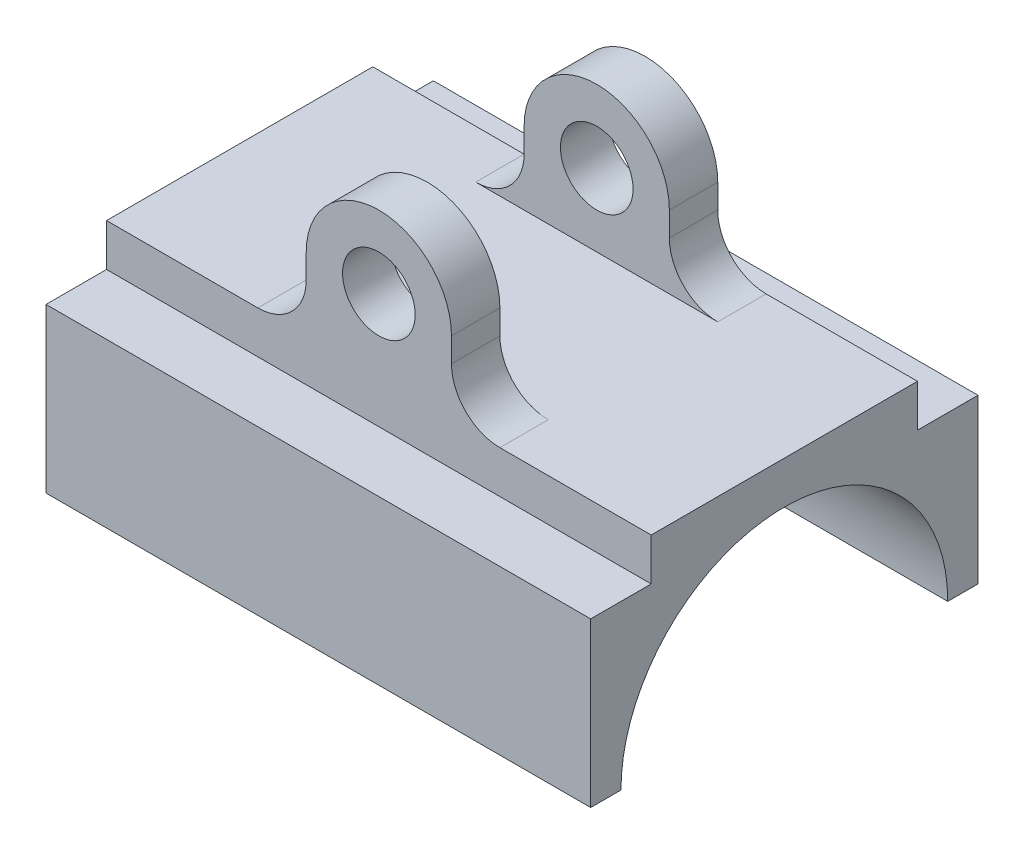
from build123d import *

# Parameters (mm, degrees)
BASE_EXTRUDE_DEPTH   = 285.75
BOSS_EXTRUDE1_DEPTH  = 25.4
FILLET1_R            = 25.4
SKETCH3_R            = 19.05
CUT_EXTRUDE1_DEPTH   = 25.4
FILLET1_OF_MIRROR1_R = 25.4


with BuildPart() as part:
    # Sketch1 → Base-Extrude (new body)
    with BuildSketch(Plane(origin=(0, 0, 0), x_dir=(0, 0, -1), z_dir=(1, 0, 0))):
        with BuildLine():
            Line((-85.725, 0), (-101.6, 0))
            Line((-101.6, 0), (-101.6, 85.725))
            Line((-101.6, 85.725), (-69.85, 85.725))
            Line((-69.85, 85.725), (-69.85, 107.95))
            Line((-69.85, 107.95), (69.85, 107.95))
            Line((69.85, 107.95), (69.85, 85.725))
            Line((69.85, 85.725), (101.6, 85.725))
            Line((101.6, 85.725), (101.6, 0))
            Line((101.6, 0), (85.725, 0))
            ThreePointArc((85.725, 0), (0, 85.725), (-85.725, 0))
        make_face()
    extrude(amount=-BASE_EXTRUDE_DEPTH)

    # Sketch2 → Boss-Extrude1 (add)
    with BuildSketch(Plane.XY.offset(69.85)):
        with BuildLine():
            Line((-180.975, 107.95), (-180.975, 146.05))
            ThreePointArc((-180.975, 146.05), (-142.875, 184.15), (-104.775, 146.05))
            Line((-104.775, 146.05), (-104.775, 107.95))
            Line((-104.775, 107.95), (-180.975, 107.95))
        make_face()
    boss_extrude1 = extrude(amount=-BOSS_EXTRUDE1_DEPTH)

    # Fillet1
    fillet1_edges = [part.edges().sort_by_distance(p)[0] for p in [
        (-104.775, 107.95, 57.15),
        (-180.975, 107.95, 57.15),
    ]]
    fillet(fillet1_edges, radius=FILLET1_R)

    # Sketch3 → Cut-Extrude1 (cut)
    with BuildSketch(Plane.XY.offset(69.85)):
        with Locations((-142.875, 146.05)):
            Circle(SKETCH3_R)
    cut_extrude1 = extrude(amount=-CUT_EXTRUDE1_DEPTH, mode=Mode.SUBTRACT)

    # Mirror1: Boss-Extrude1, Cut-Extrude1 across plane
    add(boss_extrude1.mirror(Plane.XY))
    add(cut_extrude1.mirror(Plane.XY), mode=Mode.SUBTRACT)

    # Fillet1 of Mirror1
    fillet1_of_mirror1_edges = [part.edges().sort_by_distance(p)[0] for p in [
        (-104.775, 107.95, -57.15),
        (-180.975, 107.95, -57.15),
    ]]
    fillet(fillet1_of_mirror1_edges, radius=FILLET1_OF_MIRROR1_R)


solid = part.part
